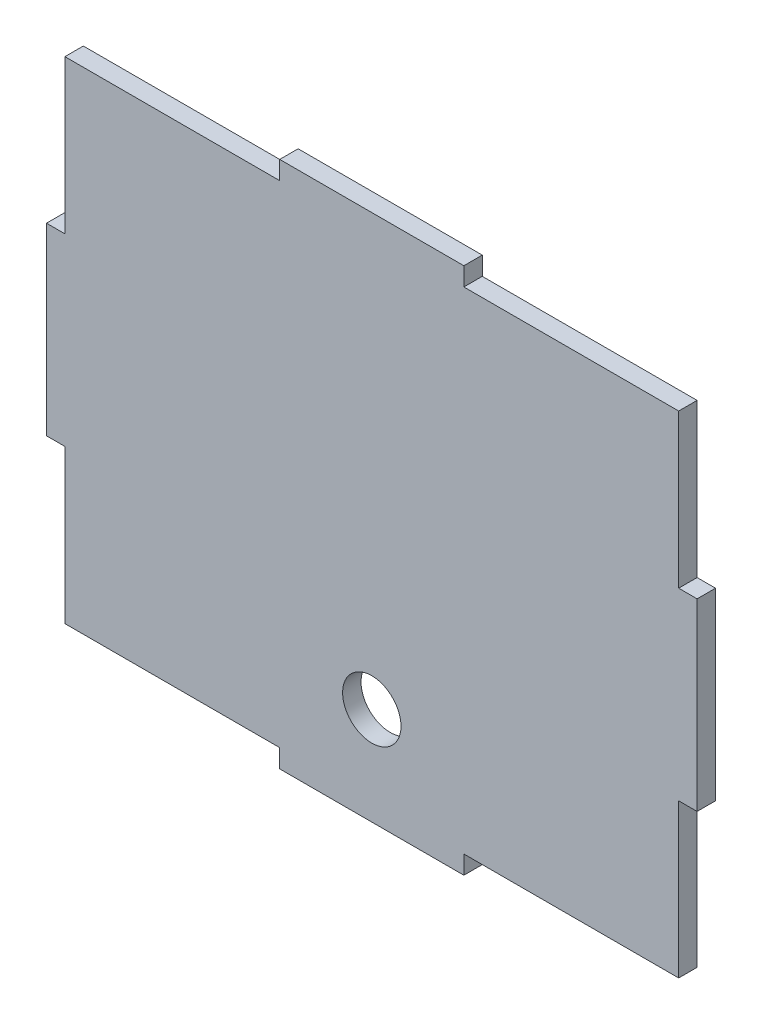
from build123d import *

# Parameters (mm, degrees)
CROQUIS1_R              = 4.755
SALIENTE_EXTRUIR1_DEPTH = 3


with BuildPart() as part:
    # Croquis1 → Saliente-Extruir1 (new body)
    with BuildSketch(Plane.XY):
        Polygon((15, 40), (50, 40), (50, 15), (53, 15), (53, -15), (50, -15), (50, -40), (15, -40), (15, -43), (-15, -43), (-15, -40), (-50, -40), (-50, -15), (-53, -15), (-53, 15), (-50, 15), (-50, 40), (-15, 40), (-15, 43), (15, 43), align=None)
        with Locations((0, -27.103728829)):
            Circle(CROQUIS1_R, mode=Mode.SUBTRACT)
    extrude(amount=SALIENTE_EXTRUIR1_DEPTH)


solid = part.part
